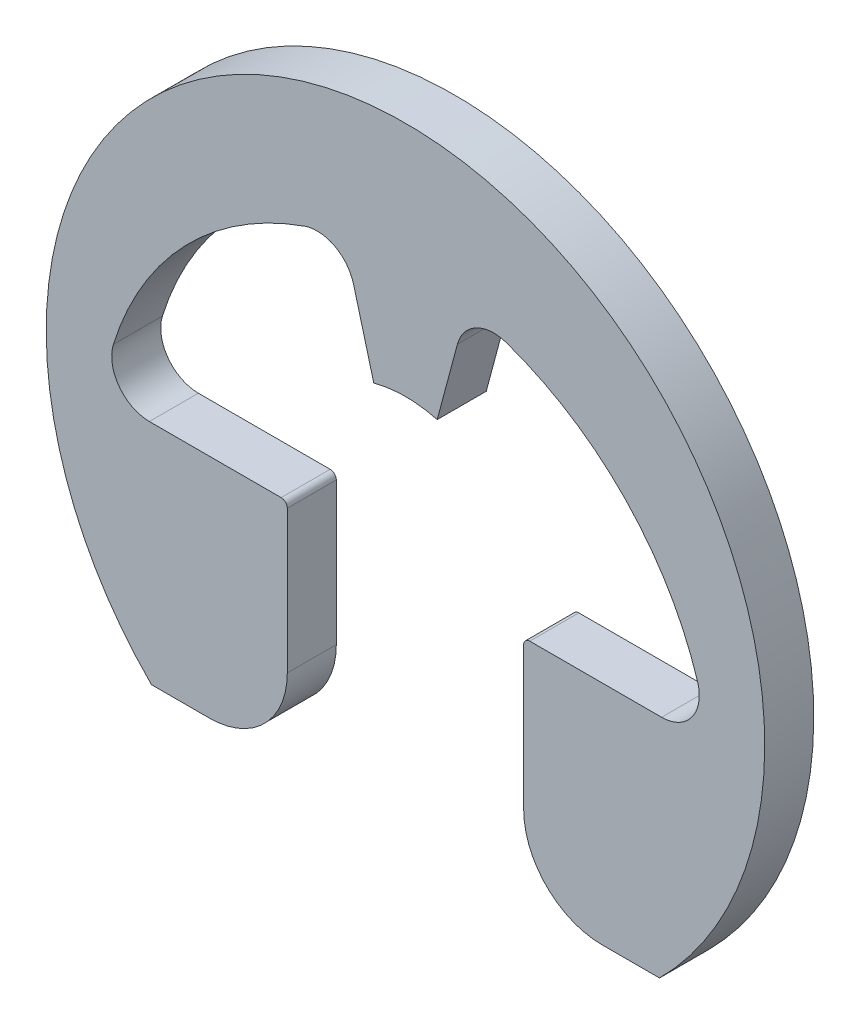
from build123d import *

# Parameters (mm, degrees)
BODY_DEPTH = 0.6


with BuildPart() as part:
    # BodySke → Body (new body)
    with BuildSketch(Plane.XY):
        with BuildLine():
            Line((3.108831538, -3.108831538), (2.402195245, -3.108831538))
            ThreePointArc((2.402195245, -3.108831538), (1.726298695, -2.82886602), (1.446333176, -2.152969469))
            Line((1.446333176, -2.152969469), (1.446333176, -0.407639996))
            ThreePointArc((1.446333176, -0.407639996), (1.468300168, -0.354606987), (1.521333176, -0.332639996))
            Line((1.521333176, -0.332639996), (3.134556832, -0.332639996))
            ThreePointArc((3.134556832, -0.332639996), (3.505701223, -0.144991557), (3.57460913, 0.265144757))
            ThreePointArc((3.57460913, 0.265144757), (2.691532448, 1.754933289), (1.232448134, 2.687868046))
            ThreePointArc((1.232448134, 2.687868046), (0.865150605, 2.660029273), (0.635569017, 2.371975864))
            Line((0.635569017, 2.371975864), (0.388228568, 1.448888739))
            ThreePointArc((0.388228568, 1.448888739), (0, 1.5), (-0.388228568, 1.448888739))
            Line((-0.388228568, 1.448888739), (-0.635569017, 2.371975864))
            ThreePointArc((-0.635569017, 2.371975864), (-0.865150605, 2.660029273), (-1.232448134, 2.687868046))
            ThreePointArc((-1.232448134, 2.687868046), (-2.691532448, 1.754933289), (-3.57460913, 0.265144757))
            ThreePointArc((-3.57460913, 0.265144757), (-3.505701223, -0.144991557), (-3.134556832, -0.332639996))
            Line((-3.134556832, -0.332639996), (-1.521333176, -0.332639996))
            ThreePointArc((-1.521333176, -0.332639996), (-1.468300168, -0.354606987), (-1.446333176, -0.407639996))
            Line((-1.446333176, -0.407639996), (-1.446333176, -2.152969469))
            ThreePointArc((-1.446333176, -2.152969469), (-1.726298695, -2.82886602), (-2.402195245, -3.108831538))
            Line((-2.402195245, -3.108831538), (-3.108831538, -3.108831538))
            ThreePointArc((-3.108831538, -3.108831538), (0, 4.396551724), (3.108831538, -3.108831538))
        make_face()
    extrude(amount=-BODY_DEPTH)


solid = part.part
